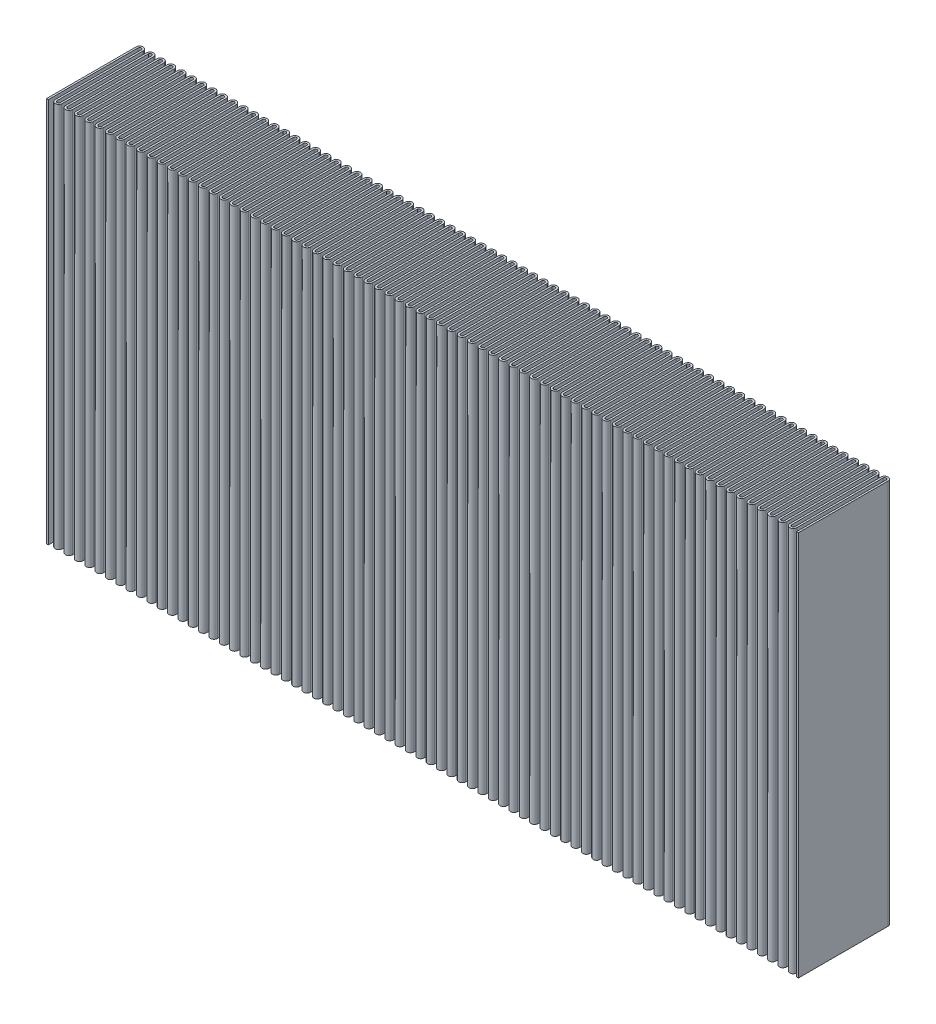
from build123d import *

# Parameters (mm, degrees)
BOSS_EXTRUDE1_DEPTH = 41


with BuildPart() as part:
    # Sketch1 → Boss-Extrude1 (new body)
    with BuildSketch(Plane(origin=(0, 0, 0), x_dir=(1, 0, 0), z_dir=(0, 1, 0))):
        with BuildLine():
            ThreePointArc((0, 9.7), (0.123743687, 9.648743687), (0.175, 9.525))
            Line((0.175, 9.525), (0.175, 0.375))
            ThreePointArc((0.175, 0.375), (0.284834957, 0.109834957), (0.55, 0))
            Line((0.55, 0), (0.55, 0.2))
            ThreePointArc((0.55, 0.2), (0.426256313, 0.251256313), (0.375, 0.375))
            Line((0.375, 0.375), (0.375, 9.525))
            ThreePointArc((0.375, 9.525), (0.265165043, 9.790165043), (0, 9.9))
            Line((0, 9.9), (0, 9.7))
        make_face()
        with BuildLine():
            ThreePointArc((-0.175, 9.525), (-0.123743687, 9.648743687), (0, 9.7))
            Line((0, 9.7), (0, 9.9))
            ThreePointArc((0, 9.9), (-0.265165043, 9.790165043), (-0.375, 9.525))
            Line((-0.375, 9.525), (-0.375, 0.375))
            Line((-0.375, 0.375), (-0.375, 0))
            Line((-0.375, 0), (-0.175, 0))
            Line((-0.175, 0), (-0.175, 0.375))
            Line((-0.175, 0.375), (-0.175, 9.525))
        make_face()
        with BuildLine():
            Line((0.55, 0.2), (0.55, 0))
            ThreePointArc((0.55, 0), (0.815165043, 0.109834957), (0.925, 0.375))
            Line((0.925, 0.375), (0.925, 9.525))
            ThreePointArc((0.925, 9.525), (0.976256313, 9.648743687), (1.1, 9.7))
            ThreePointArc((1.1, 9.7), (1.223743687, 9.648743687), (1.275, 9.525))
            Line((1.275, 9.525), (1.275, 0.375))
            ThreePointArc((1.275, 0.375), (1.65, 0), (2.025, 0.375))
            Line((2.025, 0.375), (2.025, 9.525))
            ThreePointArc((2.025, 9.525), (2.076256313, 9.648743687), (2.2, 9.7))
            ThreePointArc((2.2, 9.7), (2.323743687, 9.648743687), (2.375, 9.525))
            Line((2.375, 9.525), (2.375, 0.375))
            ThreePointArc((2.375, 0.375), (2.75, 0), (3.125, 0.375))
            Line((3.125, 0.375), (3.125, 9.525))
            ThreePointArc((3.125, 9.525), (3.176256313, 9.648743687), (3.3, 9.7))
            ThreePointArc((3.3, 9.7), (3.423743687, 9.648743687), (3.475, 9.525))
            Line((3.475, 9.525), (3.475, 0.375))
            ThreePointArc((3.475, 0.375), (3.85, 0), (4.225, 0.375))
            Line((4.225, 0.375), (4.225, 9.525))
            ThreePointArc((4.225, 9.525), (4.276256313, 9.648743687), (4.4, 9.7))
            ThreePointArc((4.4, 9.7), (4.523743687, 9.648743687), (4.575, 9.525))
            Line((4.575, 9.525), (4.575, 0.375))
            ThreePointArc((4.575, 0.375), (4.95, 0), (5.325, 0.375))
            Line((5.325, 0.375), (5.325, 9.525))
            ThreePointArc((5.325, 9.525), (5.376256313, 9.648743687), (5.5, 9.7))
            ThreePointArc((5.5, 9.7), (5.623743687, 9.648743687), (5.675, 9.525))
            Line((5.675, 9.525), (5.675, 0.375))
            ThreePointArc((5.675, 0.375), (6.05, 0), (6.425, 0.375))
            Line((6.425, 0.375), (6.425, 9.525))
            ThreePointArc((6.425, 9.525), (6.476256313, 9.648743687), (6.6, 9.7))
            ThreePointArc((6.6, 9.7), (6.723743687, 9.648743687), (6.775, 9.525))
            Line((6.775, 9.525), (6.775, 0.375))
            ThreePointArc((6.775, 0.375), (7.15, 0), (7.525, 0.375))
            Line((7.525, 0.375), (7.525, 9.525))
            ThreePointArc((7.525, 9.525), (7.576256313, 9.648743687), (7.7, 9.7))
            ThreePointArc((7.7, 9.7), (7.823743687, 9.648743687), (7.875, 9.525))
            Line((7.875, 9.525), (7.875, 0.375))
            ThreePointArc((7.875, 0.375), (8.25, 0), (8.625, 0.375))
            Line((8.625, 0.375), (8.625, 9.525))
            ThreePointArc((8.625, 9.525), (8.676256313, 9.648743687), (8.8, 9.7))
            ThreePointArc((8.8, 9.7), (8.923743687, 9.648743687), (8.975, 9.525))
            Line((8.975, 9.525), (8.975, 0.375))
            ThreePointArc((8.975, 0.375), (9.35, 0), (9.725, 0.375))
            Line((9.725, 0.375), (9.725, 9.525))
            ThreePointArc((9.725, 9.525), (9.776256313, 9.648743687), (9.9, 9.7))
            ThreePointArc((9.9, 9.7), (10.023743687, 9.648743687), (10.075, 9.525))
            Line((10.075, 9.525), (10.075, 0.375))
            ThreePointArc((10.075, 0.375), (10.45, 0), (10.825, 0.375))
            Line((10.825, 0.375), (10.825, 9.525))
            ThreePointArc((10.825, 9.525), (10.876256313, 9.648743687), (11, 9.7))
            ThreePointArc((11, 9.7), (11.123743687, 9.648743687), (11.175, 9.525))
            Line((11.175, 9.525), (11.175, 0.375))
            ThreePointArc((11.175, 0.375), (11.55, 0), (11.925, 0.375))
            Line((11.925, 0.375), (11.925, 9.525))
            ThreePointArc((11.925, 9.525), (11.976256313, 9.648743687), (12.1, 9.7))
            ThreePointArc((12.1, 9.7), (12.223743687, 9.648743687), (12.275, 9.525))
            Line((12.275, 9.525), (12.275, 0.375))
            ThreePointArc((12.275, 0.375), (12.65, 0), (13.025, 0.375))
            Line((13.025, 0.375), (13.025, 9.525))
            ThreePointArc((13.025, 9.525), (13.076256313, 9.648743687), (13.2, 9.7))
            ThreePointArc((13.2, 9.7), (13.323743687, 9.648743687), (13.375, 9.525))
            Line((13.375, 9.525), (13.375, 0.375))
            ThreePointArc((13.375, 0.375), (13.75, 0), (14.125, 0.375))
            Line((14.125, 0.375), (14.125, 9.525))
            ThreePointArc((14.125, 9.525), (14.176256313, 9.648743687), (14.3, 9.7))
            ThreePointArc((14.3, 9.7), (14.423743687, 9.648743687), (14.475, 9.525))
            Line((14.475, 9.525), (14.475, 0.375))
            ThreePointArc((14.475, 0.375), (14.85, 0), (15.225, 0.375))
            Line((15.225, 0.375), (15.225, 9.525))
            ThreePointArc((15.225, 9.525), (15.276256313, 9.648743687), (15.4, 9.7))
            ThreePointArc((15.4, 9.7), (15.523743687, 9.648743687), (15.575, 9.525))
            Line((15.575, 9.525), (15.575, 0.375))
            ThreePointArc((15.575, 0.375), (15.95, 0), (16.325, 0.375))
            Line((16.325, 0.375), (16.325, 9.525))
            ThreePointArc((16.325, 9.525), (16.376256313, 9.648743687), (16.5, 9.7))
            ThreePointArc((16.5, 9.7), (16.623743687, 9.648743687), (16.675, 9.525))
            Line((16.675, 9.525), (16.675, 0.375))
            ThreePointArc((16.675, 0.375), (17.05, 0), (17.425, 0.375))
            Line((17.425, 0.375), (17.425, 9.525))
            ThreePointArc((17.425, 9.525), (17.476256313, 9.648743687), (17.6, 9.7))
            ThreePointArc((17.6, 9.7), (17.723743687, 9.648743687), (17.775, 9.525))
            Line((17.775, 9.525), (17.775, 0.375))
            ThreePointArc((17.775, 0.375), (18.15, 0), (18.525, 0.375))
            Line((18.525, 0.375), (18.525, 9.525))
            ThreePointArc((18.525, 9.525), (18.576256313, 9.648743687), (18.7, 9.7))
            ThreePointArc((18.7, 9.7), (18.823743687, 9.648743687), (18.875, 9.525))
            Line((18.875, 9.525), (18.875, 0.375))
            ThreePointArc((18.875, 0.375), (19.25, 0), (19.625, 0.375))
            Line((19.625, 0.375), (19.625, 9.525))
            ThreePointArc((19.625, 9.525), (19.676256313, 9.648743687), (19.8, 9.7))
            ThreePointArc((19.8, 9.7), (19.923743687, 9.648743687), (19.975, 9.525))
            Line((19.975, 9.525), (19.975, 0.375))
            ThreePointArc((19.975, 0.375), (20.35, 0), (20.725, 0.375))
            Line((20.725, 0.375), (20.725, 9.525))
            ThreePointArc((20.725, 9.525), (20.776256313, 9.648743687), (20.9, 9.7))
            ThreePointArc((20.9, 9.7), (21.023743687, 9.648743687), (21.075, 9.525))
            Line((21.075, 9.525), (21.075, 0.375))
            ThreePointArc((21.075, 0.375), (21.45, 0), (21.825, 0.375))
            Line((21.825, 0.375), (21.825, 9.525))
            ThreePointArc((21.825, 9.525), (21.876256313, 9.648743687), (22, 9.7))
            ThreePointArc((22, 9.7), (22.123743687, 9.648743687), (22.175, 9.525))
            Line((22.175, 9.525), (22.175, 0.375))
            ThreePointArc((22.175, 0.375), (22.55, 0), (22.925, 0.375))
            Line((22.925, 0.375), (22.925, 9.525))
            ThreePointArc((22.925, 9.525), (22.976256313, 9.648743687), (23.1, 9.7))
            ThreePointArc((23.1, 9.7), (23.223743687, 9.648743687), (23.275, 9.525))
            Line((23.275, 9.525), (23.275, 0.375))
            ThreePointArc((23.275, 0.375), (23.65, 0), (24.025, 0.375))
            Line((24.025, 0.375), (24.025, 9.525))
            ThreePointArc((24.025, 9.525), (24.076256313, 9.648743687), (24.2, 9.7))
            ThreePointArc((24.2, 9.7), (24.323743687, 9.648743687), (24.375, 9.525))
            Line((24.375, 9.525), (24.375, 0.375))
            ThreePointArc((24.375, 0.375), (24.75, 0), (25.125, 0.375))
            Line((25.125, 0.375), (25.125, 9.525))
            ThreePointArc((25.125, 9.525), (25.176256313, 9.648743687), (25.3, 9.7))
            ThreePointArc((25.3, 9.7), (25.423743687, 9.648743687), (25.475, 9.525))
            Line((25.475, 9.525), (25.475, 0.375))
            ThreePointArc((25.475, 0.375), (25.85, 0), (26.225, 0.375))
            Line((26.225, 0.375), (26.225, 9.525))
            ThreePointArc((26.225, 9.525), (26.276256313, 9.648743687), (26.4, 9.7))
            ThreePointArc((26.4, 9.7), (26.523743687, 9.648743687), (26.575, 9.525))
            Line((26.575, 9.525), (26.575, 0.375))
            ThreePointArc((26.575, 0.375), (26.95, 0), (27.325, 0.375))
            Line((27.325, 0.375), (27.325, 9.525))
            ThreePointArc((27.325, 9.525), (27.376256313, 9.648743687), (27.5, 9.7))
            ThreePointArc((27.5, 9.7), (27.623743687, 9.648743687), (27.675, 9.525))
            Line((27.675, 9.525), (27.675, 0.375))
            ThreePointArc((27.675, 0.375), (28.05, 0), (28.425, 0.375))
            Line((28.425, 0.375), (28.425, 9.525))
            ThreePointArc((28.425, 9.525), (28.476256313, 9.648743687), (28.6, 9.7))
            ThreePointArc((28.6, 9.7), (28.723743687, 9.648743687), (28.775, 9.525))
            Line((28.775, 9.525), (28.775, 0.375))
            ThreePointArc((28.775, 0.375), (29.15, 0), (29.525, 0.375))
            Line((29.525, 0.375), (29.525, 9.525))
            ThreePointArc((29.525, 9.525), (29.576256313, 9.648743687), (29.7, 9.7))
            ThreePointArc((29.7, 9.7), (29.823743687, 9.648743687), (29.875, 9.525))
            Line((29.875, 9.525), (29.875, 0.375))
            ThreePointArc((29.875, 0.375), (30.25, 0), (30.625, 0.375))
            Line((30.625, 0.375), (30.625, 9.525))
            ThreePointArc((30.625, 9.525), (30.676256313, 9.648743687), (30.8, 9.7))
            ThreePointArc((30.8, 9.7), (30.923743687, 9.648743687), (30.975, 9.525))
            Line((30.975, 9.525), (30.975, 0.375))
            ThreePointArc((30.975, 0.375), (31.35, 0), (31.725, 0.375))
            Line((31.725, 0.375), (31.725, 9.525))
            ThreePointArc((31.725, 9.525), (31.776256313, 9.648743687), (31.9, 9.7))
            ThreePointArc((31.9, 9.7), (32.023743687, 9.648743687), (32.075, 9.525))
            Line((32.075, 9.525), (32.075, 0.375))
            ThreePointArc((32.075, 0.375), (32.45, 0), (32.825, 0.375))
            Line((32.825, 0.375), (32.825, 9.525))
            ThreePointArc((32.825, 9.525), (32.876256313, 9.648743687), (33, 9.7))
            ThreePointArc((33, 9.7), (33.123743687, 9.648743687), (33.175, 9.525))
            Line((33.175, 9.525), (33.175, 0.375))
            ThreePointArc((33.175, 0.375), (33.55, 0), (33.925, 0.375))
            Line((33.925, 0.375), (33.925, 9.525))
            ThreePointArc((33.925, 9.525), (33.976256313, 9.648743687), (34.1, 9.7))
            ThreePointArc((34.1, 9.7), (34.223743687, 9.648743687), (34.275, 9.525))
            Line((34.275, 9.525), (34.275, 0.375))
            ThreePointArc((34.275, 0.375), (34.65, 0), (35.025, 0.375))
            Line((35.025, 0.375), (35.025, 9.525))
            ThreePointArc((35.025, 9.525), (35.076256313, 9.648743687), (35.2, 9.7))
            ThreePointArc((35.2, 9.7), (35.323743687, 9.648743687), (35.375, 9.525))
            Line((35.375, 9.525), (35.375, 0.375))
            ThreePointArc((35.375, 0.375), (35.75, 0), (36.125, 0.375))
            Line((36.125, 0.375), (36.125, 9.525))
            ThreePointArc((36.125, 9.525), (36.176256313, 9.648743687), (36.3, 9.7))
            ThreePointArc((36.3, 9.7), (36.423743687, 9.648743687), (36.475, 9.525))
            Line((36.475, 9.525), (36.475, 0.375))
            ThreePointArc((36.475, 0.375), (36.85, 0), (37.225, 0.375))
            Line((37.225, 0.375), (37.225, 9.525))
            ThreePointArc((37.225, 9.525), (37.276256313, 9.648743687), (37.4, 9.7))
            ThreePointArc((37.4, 9.7), (37.523743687, 9.648743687), (37.575, 9.525))
            Line((37.575, 9.525), (37.575, 0.375))
            ThreePointArc((37.575, 0.375), (37.95, 0), (38.325, 0.375))
            Line((38.325, 0.375), (38.325, 9.525))
            ThreePointArc((38.325, 9.525), (38.376256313, 9.648743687), (38.5, 9.7))
            ThreePointArc((38.5, 9.7), (38.623743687, 9.648743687), (38.675, 9.525))
            Line((38.675, 9.525), (38.675, 0.375))
            ThreePointArc((38.675, 0.375), (39.05, 0), (39.425, 0.375))
            Line((39.425, 0.375), (39.425, 9.525))
            ThreePointArc((39.425, 9.525), (39.476256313, 9.648743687), (39.6, 9.7))
            ThreePointArc((39.6, 9.7), (39.723743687, 9.648743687), (39.775, 9.525))
            Line((39.775, 9.525), (39.775, 0.375))
            ThreePointArc((39.775, 0.375), (40.15, 0), (40.525, 0.375))
            Line((40.525, 0.375), (40.525, 9.525))
            ThreePointArc((40.525, 9.525), (40.576256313, 9.648743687), (40.7, 9.7))
            ThreePointArc((40.7, 9.7), (40.823743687, 9.648743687), (40.875, 9.525))
            Line((40.875, 9.525), (40.875, 0.375))
            ThreePointArc((40.875, 0.375), (41.25, 0), (41.625, 0.375))
            Line((41.625, 0.375), (41.625, 9.525))
            ThreePointArc((41.625, 9.525), (41.676256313, 9.648743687), (41.8, 9.7))
            ThreePointArc((41.8, 9.7), (41.923743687, 9.648743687), (41.975, 9.525))
            Line((41.975, 9.525), (41.975, 0.375))
            ThreePointArc((41.975, 0.375), (42.35, 0), (42.725, 0.375))
            Line((42.725, 0.375), (42.725, 9.525))
            ThreePointArc((42.725, 9.525), (42.776256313, 9.648743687), (42.9, 9.7))
            ThreePointArc((42.9, 9.7), (43.023743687, 9.648743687), (43.075, 9.525))
            Line((43.075, 9.525), (43.075, 0.375))
            ThreePointArc((43.075, 0.375), (43.45, 0), (43.825, 0.375))
            Line((43.825, 0.375), (43.825, 9.525))
            ThreePointArc((43.825, 9.525), (43.876256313, 9.648743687), (44, 9.7))
            ThreePointArc((44, 9.7), (44.123743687, 9.648743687), (44.175, 9.525))
            Line((44.175, 9.525), (44.175, 0.375))
            ThreePointArc((44.175, 0.375), (44.55, 0), (44.925, 0.375))
            Line((44.925, 0.375), (44.925, 9.525))
            ThreePointArc((44.925, 9.525), (44.976256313, 9.648743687), (45.1, 9.7))
            ThreePointArc((45.1, 9.7), (45.223743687, 9.648743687), (45.275, 9.525))
            Line((45.275, 9.525), (45.275, 0.375))
            ThreePointArc((45.275, 0.375), (45.65, 0), (46.025, 0.375))
            Line((46.025, 0.375), (46.025, 9.525))
            ThreePointArc((46.025, 9.525), (46.076256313, 9.648743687), (46.2, 9.7))
            ThreePointArc((46.2, 9.7), (46.323743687, 9.648743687), (46.375, 9.525))
            Line((46.375, 9.525), (46.375, 0.375))
            ThreePointArc((46.375, 0.375), (46.75, 0), (47.125, 0.375))
            Line((47.125, 0.375), (47.125, 9.525))
            ThreePointArc((47.125, 9.525), (47.176256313, 9.648743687), (47.3, 9.7))
            ThreePointArc((47.3, 9.7), (47.423743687, 9.648743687), (47.475, 9.525))
            Line((47.475, 9.525), (47.475, 0.375))
            ThreePointArc((47.475, 0.375), (47.85, 0), (48.225, 0.375))
            Line((48.225, 0.375), (48.225, 9.525))
            ThreePointArc((48.225, 9.525), (48.276256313, 9.648743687), (48.4, 9.7))
            ThreePointArc((48.4, 9.7), (48.523743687, 9.648743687), (48.575, 9.525))
            Line((48.575, 9.525), (48.575, 0.375))
            ThreePointArc((48.575, 0.375), (48.95, 0), (49.325, 0.375))
            Line((49.325, 0.375), (49.325, 9.525))
            ThreePointArc((49.325, 9.525), (49.376256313, 9.648743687), (49.5, 9.7))
            ThreePointArc((49.5, 9.7), (49.623743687, 9.648743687), (49.675, 9.525))
            Line((49.675, 9.525), (49.675, 0.375))
            ThreePointArc((49.675, 0.375), (50.05, 0), (50.425, 0.375))
            Line((50.425, 0.375), (50.425, 9.525))
            ThreePointArc((50.425, 9.525), (50.476256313, 9.648743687), (50.6, 9.7))
            ThreePointArc((50.6, 9.7), (50.723743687, 9.648743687), (50.775, 9.525))
            Line((50.775, 9.525), (50.775, 0.375))
            ThreePointArc((50.775, 0.375), (51.15, 0), (51.525, 0.375))
            Line((51.525, 0.375), (51.525, 9.525))
            ThreePointArc((51.525, 9.525), (51.576256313, 9.648743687), (51.7, 9.7))
            ThreePointArc((51.7, 9.7), (51.823743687, 9.648743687), (51.875, 9.525))
            Line((51.875, 9.525), (51.875, 0.375))
            ThreePointArc((51.875, 0.375), (52.25, 0), (52.625, 0.375))
            Line((52.625, 0.375), (52.625, 9.525))
            ThreePointArc((52.625, 9.525), (52.676256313, 9.648743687), (52.8, 9.7))
            ThreePointArc((52.8, 9.7), (52.923743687, 9.648743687), (52.975, 9.525))
            Line((52.975, 9.525), (52.975, 0.375))
            ThreePointArc((52.975, 0.375), (53.35, 0), (53.725, 0.375))
            Line((53.725, 0.375), (53.725, 9.525))
            ThreePointArc((53.725, 9.525), (53.776256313, 9.648743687), (53.9, 9.7))
            ThreePointArc((53.9, 9.7), (54.023743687, 9.648743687), (54.075, 9.525))
            Line((54.075, 9.525), (54.075, 0.375))
            ThreePointArc((54.075, 0.375), (54.45, 0), (54.825, 0.375))
            Line((54.825, 0.375), (54.825, 9.525))
            ThreePointArc((54.825, 9.525), (54.876256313, 9.648743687), (55, 9.7))
            ThreePointArc((55, 9.7), (55.123743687, 9.648743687), (55.175, 9.525))
            Line((55.175, 9.525), (55.175, 0.375))
            ThreePointArc((55.175, 0.375), (55.55, 0), (55.925, 0.375))
            Line((55.925, 0.375), (55.925, 9.525))
            ThreePointArc((55.925, 9.525), (55.976256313, 9.648743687), (56.1, 9.7))
            ThreePointArc((56.1, 9.7), (56.223743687, 9.648743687), (56.275, 9.525))
            Line((56.275, 9.525), (56.275, 0.375))
            ThreePointArc((56.275, 0.375), (56.65, 0), (57.025, 0.375))
            Line((57.025, 0.375), (57.025, 9.525))
            ThreePointArc((57.025, 9.525), (57.076256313, 9.648743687), (57.2, 9.7))
            ThreePointArc((57.2, 9.7), (57.323743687, 9.648743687), (57.375, 9.525))
            Line((57.375, 9.525), (57.375, 0.375))
            ThreePointArc((57.375, 0.375), (57.75, 0), (58.125, 0.375))
            Line((58.125, 0.375), (58.125, 9.525))
            ThreePointArc((58.125, 9.525), (58.176256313, 9.648743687), (58.3, 9.7))
            ThreePointArc((58.3, 9.7), (58.423743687, 9.648743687), (58.475, 9.525))
            Line((58.475, 9.525), (58.475, 0.375))
            ThreePointArc((58.475, 0.375), (58.85, 0), (59.225, 0.375))
            Line((59.225, 0.375), (59.225, 9.525))
            ThreePointArc((59.225, 9.525), (59.276256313, 9.648743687), (59.4, 9.7))
            ThreePointArc((59.4, 9.7), (59.523743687, 9.648743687), (59.575, 9.525))
            Line((59.575, 9.525), (59.575, 0.375))
            ThreePointArc((59.575, 0.375), (59.95, 0), (60.325, 0.375))
            Line((60.325, 0.375), (60.325, 9.525))
            ThreePointArc((60.325, 9.525), (60.376256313, 9.648743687), (60.5, 9.7))
            ThreePointArc((60.5, 9.7), (60.623743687, 9.648743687), (60.675, 9.525))
            Line((60.675, 9.525), (60.675, 0.375))
            ThreePointArc((60.675, 0.375), (61.05, 0), (61.425, 0.375))
            Line((61.425, 0.375), (61.425, 9.525))
            ThreePointArc((61.425, 9.525), (61.476256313, 9.648743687), (61.6, 9.7))
            ThreePointArc((61.6, 9.7), (61.723743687, 9.648743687), (61.775, 9.525))
            Line((61.775, 9.525), (61.775, 0.375))
            ThreePointArc((61.775, 0.375), (62.15, 0), (62.525, 0.375))
            Line((62.525, 0.375), (62.525, 9.525))
            ThreePointArc((62.525, 9.525), (62.576256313, 9.648743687), (62.7, 9.7))
            ThreePointArc((62.7, 9.7), (62.823743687, 9.648743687), (62.875, 9.525))
            Line((62.875, 9.525), (62.875, 0.375))
            ThreePointArc((62.875, 0.375), (63.25, 0), (63.625, 0.375))
            Line((63.625, 0.375), (63.625, 9.525))
            ThreePointArc((63.625, 9.525), (63.676256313, 9.648743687), (63.8, 9.7))
            ThreePointArc((63.8, 9.7), (63.923743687, 9.648743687), (63.975, 9.525))
            Line((63.975, 9.525), (63.975, 0.375))
            ThreePointArc((63.975, 0.375), (64.35, 0), (64.725, 0.375))
            Line((64.725, 0.375), (64.725, 9.525))
            ThreePointArc((64.725, 9.525), (64.776256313, 9.648743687), (64.9, 9.7))
            ThreePointArc((64.9, 9.7), (65.023743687, 9.648743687), (65.075, 9.525))
            Line((65.075, 9.525), (65.075, 0.375))
            ThreePointArc((65.075, 0.375), (65.45, 0), (65.825, 0.375))
            Line((65.825, 0.375), (65.825, 9.525))
            ThreePointArc((65.825, 9.525), (65.876256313, 9.648743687), (66, 9.7))
            ThreePointArc((66, 9.7), (66.123743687, 9.648743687), (66.175, 9.525))
            Line((66.175, 9.525), (66.175, 0.375))
            ThreePointArc((66.175, 0.375), (66.55, 0), (66.925, 0.375))
            Line((66.925, 0.375), (66.925, 9.525))
            ThreePointArc((66.925, 9.525), (66.976256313, 9.648743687), (67.1, 9.7))
            ThreePointArc((67.1, 9.7), (67.223743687, 9.648743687), (67.275, 9.525))
            Line((67.275, 9.525), (67.275, 0.375))
            ThreePointArc((67.275, 0.375), (67.65, 0), (68.025, 0.375))
            Line((68.025, 0.375), (68.025, 9.525))
            ThreePointArc((68.025, 9.525), (68.076256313, 9.648743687), (68.2, 9.7))
            ThreePointArc((68.2, 9.7), (68.323743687, 9.648743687), (68.375, 9.525))
            Line((68.375, 9.525), (68.375, 0.375))
            ThreePointArc((68.375, 0.375), (68.75, 0), (69.125, 0.375))
            Line((69.125, 0.375), (69.125, 9.525))
            ThreePointArc((69.125, 9.525), (69.176256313, 9.648743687), (69.3, 9.7))
            ThreePointArc((69.3, 9.7), (69.423743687, 9.648743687), (69.475, 9.525))
            Line((69.475, 9.525), (69.475, 0.375))
            ThreePointArc((69.475, 0.375), (69.85, 0), (70.225, 0.375))
            Line((70.225, 0.375), (70.225, 9.525))
            ThreePointArc((70.225, 9.525), (70.276256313, 9.648743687), (70.4, 9.7))
            ThreePointArc((70.4, 9.7), (70.523743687, 9.648743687), (70.575, 9.525))
            Line((70.575, 9.525), (70.575, 0.375))
            ThreePointArc((70.575, 0.375), (70.95, 0), (71.325, 0.375))
            Line((71.325, 0.375), (71.325, 9.525))
            ThreePointArc((71.325, 9.525), (71.376256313, 9.648743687), (71.5, 9.7))
            ThreePointArc((71.5, 9.7), (71.623743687, 9.648743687), (71.675, 9.525))
            Line((71.675, 9.525), (71.675, 0.375))
            ThreePointArc((71.675, 0.375), (72.05, 0), (72.425, 0.375))
            Line((72.425, 0.375), (72.425, 9.525))
            ThreePointArc((72.425, 9.525), (72.476256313, 9.648743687), (72.6, 9.7))
            ThreePointArc((72.6, 9.7), (72.723743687, 9.648743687), (72.775, 9.525))
            Line((72.775, 9.525), (72.775, 0.375))
            ThreePointArc((72.775, 0.375), (73.15, 0), (73.525, 0.375))
            Line((73.525, 0.375), (73.525, 9.525))
            ThreePointArc((73.525, 9.525), (73.576256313, 9.648743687), (73.7, 9.7))
            ThreePointArc((73.7, 9.7), (73.823743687, 9.648743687), (73.875, 9.525))
            Line((73.875, 9.525), (73.875, 0.375))
            ThreePointArc((73.875, 0.375), (74.25, 0), (74.625, 0.375))
            Line((74.625, 0.375), (74.625, 9.525))
            ThreePointArc((74.625, 9.525), (74.676256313, 9.648743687), (74.8, 9.7))
            ThreePointArc((74.8, 9.7), (74.923743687, 9.648743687), (74.975, 9.525))
            Line((74.975, 9.525), (74.975, 0.375))
            ThreePointArc((74.975, 0.375), (75.35, 0), (75.725, 0.375))
            Line((75.725, 0.375), (75.725, 9.525))
            ThreePointArc((75.725, 9.525), (75.776256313, 9.648743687), (75.9, 9.7))
            ThreePointArc((75.9, 9.7), (76.023743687, 9.648743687), (76.075, 9.525))
            Line((76.075, 9.525), (76.075, 0.375))
            ThreePointArc((76.075, 0.375), (76.45, 0), (76.825, 0.375))
            Line((76.825, 0.375), (76.825, 9.525))
            ThreePointArc((76.825, 9.525), (76.876256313, 9.648743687), (77, 9.7))
            ThreePointArc((77, 9.7), (77.123743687, 9.648743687), (77.175, 9.525))
            Line((77.175, 9.525), (77.175, 0.375))
            ThreePointArc((77.175, 0.375), (77.55, 0), (77.925, 0.375))
            Line((77.925, 0.375), (77.925, 9.525))
            ThreePointArc((77.925, 9.525), (77.976256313, 9.648743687), (78.1, 9.7))
            ThreePointArc((78.1, 9.7), (78.223743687, 9.648743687), (78.275, 9.525))
            Line((78.275, 9.525), (78.275, 0.375))
            ThreePointArc((78.275, 0.375), (78.65, 0), (79.025, 0.375))
            Line((79.025, 0.375), (79.025, 9.525))
            ThreePointArc((79.025, 9.525), (79.076256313, 9.648743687), (79.2, 9.7))
            ThreePointArc((79.2, 9.7), (79.323743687, 9.648743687), (79.375, 9.525))
            Line((79.375, 9.525), (79.375, 0))
            Line((79.375, 0), (79.575, 0))
            Line((79.575, 0), (79.575, 9.525))
            ThreePointArc((79.575, 9.525), (79.465165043, 9.790165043), (79.2, 9.9))
            ThreePointArc((79.2, 9.9), (78.934834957, 9.790165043), (78.825, 9.525))
            Line((78.825, 9.525), (78.825, 0.375))
            ThreePointArc((78.825, 0.375), (78.65, 0.2), (78.475, 0.375))
            Line((78.475, 0.375), (78.475, 9.525))
            ThreePointArc((78.475, 9.525), (78.365165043, 9.790165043), (78.1, 9.9))
            ThreePointArc((78.1, 9.9), (77.834834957, 9.790165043), (77.725, 9.525))
            Line((77.725, 9.525), (77.725, 0.375))
            ThreePointArc((77.725, 0.375), (77.55, 0.2), (77.375, 0.375))
            Line((77.375, 0.375), (77.375, 9.525))
            ThreePointArc((77.375, 9.525), (77.265165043, 9.790165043), (77, 9.9))
            ThreePointArc((77, 9.9), (76.734834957, 9.790165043), (76.625, 9.525))
            Line((76.625, 9.525), (76.625, 0.375))
            ThreePointArc((76.625, 0.375), (76.45, 0.2), (76.275, 0.375))
            Line((76.275, 0.375), (76.275, 9.525))
            ThreePointArc((76.275, 9.525), (76.165165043, 9.790165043), (75.9, 9.9))
            ThreePointArc((75.9, 9.9), (75.634834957, 9.790165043), (75.525, 9.525))
            Line((75.525, 9.525), (75.525, 0.375))
            ThreePointArc((75.525, 0.375), (75.35, 0.2), (75.175, 0.375))
            Line((75.175, 0.375), (75.175, 9.525))
            ThreePointArc((75.175, 9.525), (75.065165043, 9.790165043), (74.8, 9.9))
            ThreePointArc((74.8, 9.9), (74.534834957, 9.790165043), (74.425, 9.525))
            Line((74.425, 9.525), (74.425, 0.375))
            ThreePointArc((74.425, 0.375), (74.25, 0.2), (74.075, 0.375))
            Line((74.075, 0.375), (74.075, 9.525))
            ThreePointArc((74.075, 9.525), (73.965165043, 9.790165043), (73.7, 9.9))
            ThreePointArc((73.7, 9.9), (73.434834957, 9.790165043), (73.325, 9.525))
            Line((73.325, 9.525), (73.325, 0.375))
            ThreePointArc((73.325, 0.375), (73.15, 0.2), (72.975, 0.375))
            Line((72.975, 0.375), (72.975, 9.525))
            ThreePointArc((72.975, 9.525), (72.865165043, 9.790165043), (72.6, 9.9))
            ThreePointArc((72.6, 9.9), (72.334834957, 9.790165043), (72.225, 9.525))
            Line((72.225, 9.525), (72.225, 0.375))
            ThreePointArc((72.225, 0.375), (72.05, 0.2), (71.875, 0.375))
            Line((71.875, 0.375), (71.875, 9.525))
            ThreePointArc((71.875, 9.525), (71.765165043, 9.790165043), (71.5, 9.9))
            ThreePointArc((71.5, 9.9), (71.234834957, 9.790165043), (71.125, 9.525))
            Line((71.125, 9.525), (71.125, 0.375))
            ThreePointArc((71.125, 0.375), (70.95, 0.2), (70.775, 0.375))
            Line((70.775, 0.375), (70.775, 9.525))
            ThreePointArc((70.775, 9.525), (70.665165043, 9.790165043), (70.4, 9.9))
            ThreePointArc((70.4, 9.9), (70.134834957, 9.790165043), (70.025, 9.525))
            Line((70.025, 9.525), (70.025, 0.375))
            ThreePointArc((70.025, 0.375), (69.85, 0.2), (69.675, 0.375))
            Line((69.675, 0.375), (69.675, 9.525))
            ThreePointArc((69.675, 9.525), (69.565165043, 9.790165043), (69.3, 9.9))
            ThreePointArc((69.3, 9.9), (69.034834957, 9.790165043), (68.925, 9.525))
            Line((68.925, 9.525), (68.925, 0.375))
            ThreePointArc((68.925, 0.375), (68.75, 0.2), (68.575, 0.375))
            Line((68.575, 0.375), (68.575, 9.525))
            ThreePointArc((68.575, 9.525), (68.465165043, 9.790165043), (68.2, 9.9))
            ThreePointArc((68.2, 9.9), (67.934834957, 9.790165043), (67.825, 9.525))
            Line((67.825, 9.525), (67.825, 0.375))
            ThreePointArc((67.825, 0.375), (67.65, 0.2), (67.475, 0.375))
            Line((67.475, 0.375), (67.475, 9.525))
            ThreePointArc((67.475, 9.525), (67.365165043, 9.790165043), (67.1, 9.9))
            ThreePointArc((67.1, 9.9), (66.834834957, 9.790165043), (66.725, 9.525))
            Line((66.725, 9.525), (66.725, 0.375))
            ThreePointArc((66.725, 0.375), (66.55, 0.2), (66.375, 0.375))
            Line((66.375, 0.375), (66.375, 9.525))
            ThreePointArc((66.375, 9.525), (66.265165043, 9.790165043), (66, 9.9))
            ThreePointArc((66, 9.9), (65.734834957, 9.790165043), (65.625, 9.525))
            Line((65.625, 9.525), (65.625, 0.375))
            ThreePointArc((65.625, 0.375), (65.45, 0.2), (65.275, 0.375))
            Line((65.275, 0.375), (65.275, 9.525))
            ThreePointArc((65.275, 9.525), (65.165165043, 9.790165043), (64.9, 9.9))
            ThreePointArc((64.9, 9.9), (64.634834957, 9.790165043), (64.525, 9.525))
            Line((64.525, 9.525), (64.525, 0.375))
            ThreePointArc((64.525, 0.375), (64.35, 0.2), (64.175, 0.375))
            Line((64.175, 0.375), (64.175, 9.525))
            ThreePointArc((64.175, 9.525), (64.065165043, 9.790165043), (63.8, 9.9))
            ThreePointArc((63.8, 9.9), (63.534834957, 9.790165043), (63.425, 9.525))
            Line((63.425, 9.525), (63.425, 0.375))
            ThreePointArc((63.425, 0.375), (63.25, 0.2), (63.075, 0.375))
            Line((63.075, 0.375), (63.075, 9.525))
            ThreePointArc((63.075, 9.525), (62.965165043, 9.790165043), (62.7, 9.9))
            ThreePointArc((62.7, 9.9), (62.434834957, 9.790165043), (62.325, 9.525))
            Line((62.325, 9.525), (62.325, 0.375))
            ThreePointArc((62.325, 0.375), (62.15, 0.2), (61.975, 0.375))
            Line((61.975, 0.375), (61.975, 9.525))
            ThreePointArc((61.975, 9.525), (61.865165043, 9.790165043), (61.6, 9.9))
            ThreePointArc((61.6, 9.9), (61.334834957, 9.790165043), (61.225, 9.525))
            Line((61.225, 9.525), (61.225, 0.375))
            ThreePointArc((61.225, 0.375), (61.05, 0.2), (60.875, 0.375))
            Line((60.875, 0.375), (60.875, 9.525))
            ThreePointArc((60.875, 9.525), (60.765165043, 9.790165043), (60.5, 9.9))
            ThreePointArc((60.5, 9.9), (60.234834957, 9.790165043), (60.125, 9.525))
            Line((60.125, 9.525), (60.125, 0.375))
            ThreePointArc((60.125, 0.375), (59.95, 0.2), (59.775, 0.375))
            Line((59.775, 0.375), (59.775, 9.525))
            ThreePointArc((59.775, 9.525), (59.665165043, 9.790165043), (59.4, 9.9))
            ThreePointArc((59.4, 9.9), (59.134834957, 9.790165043), (59.025, 9.525))
            Line((59.025, 9.525), (59.025, 0.375))
            ThreePointArc((59.025, 0.375), (58.85, 0.2), (58.675, 0.375))
            Line((58.675, 0.375), (58.675, 9.525))
            ThreePointArc((58.675, 9.525), (58.565165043, 9.790165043), (58.3, 9.9))
            ThreePointArc((58.3, 9.9), (58.034834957, 9.790165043), (57.925, 9.525))
            Line((57.925, 9.525), (57.925, 0.375))
            ThreePointArc((57.925, 0.375), (57.75, 0.2), (57.575, 0.375))
            Line((57.575, 0.375), (57.575, 9.525))
            ThreePointArc((57.575, 9.525), (57.465165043, 9.790165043), (57.2, 9.9))
            ThreePointArc((57.2, 9.9), (56.934834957, 9.790165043), (56.825, 9.525))
            Line((56.825, 9.525), (56.825, 0.375))
            ThreePointArc((56.825, 0.375), (56.65, 0.2), (56.475, 0.375))
            Line((56.475, 0.375), (56.475, 9.525))
            ThreePointArc((56.475, 9.525), (56.365165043, 9.790165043), (56.1, 9.9))
            ThreePointArc((56.1, 9.9), (55.834834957, 9.790165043), (55.725, 9.525))
            Line((55.725, 9.525), (55.725, 0.375))
            ThreePointArc((55.725, 0.375), (55.55, 0.2), (55.375, 0.375))
            Line((55.375, 0.375), (55.375, 9.525))
            ThreePointArc((55.375, 9.525), (55.265165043, 9.790165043), (55, 9.9))
            ThreePointArc((55, 9.9), (54.734834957, 9.790165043), (54.625, 9.525))
            Line((54.625, 9.525), (54.625, 0.375))
            ThreePointArc((54.625, 0.375), (54.45, 0.2), (54.275, 0.375))
            Line((54.275, 0.375), (54.275, 9.525))
            ThreePointArc((54.275, 9.525), (54.165165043, 9.790165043), (53.9, 9.9))
            ThreePointArc((53.9, 9.9), (53.634834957, 9.790165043), (53.525, 9.525))
            Line((53.525, 9.525), (53.525, 0.375))
            ThreePointArc((53.525, 0.375), (53.35, 0.2), (53.175, 0.375))
            Line((53.175, 0.375), (53.175, 9.525))
            ThreePointArc((53.175, 9.525), (53.065165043, 9.790165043), (52.8, 9.9))
            ThreePointArc((52.8, 9.9), (52.534834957, 9.790165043), (52.425, 9.525))
            Line((52.425, 9.525), (52.425, 0.375))
            ThreePointArc((52.425, 0.375), (52.25, 0.2), (52.075, 0.375))
            Line((52.075, 0.375), (52.075, 9.525))
            ThreePointArc((52.075, 9.525), (51.965165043, 9.790165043), (51.7, 9.9))
            ThreePointArc((51.7, 9.9), (51.434834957, 9.790165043), (51.325, 9.525))
            Line((51.325, 9.525), (51.325, 0.375))
            ThreePointArc((51.325, 0.375), (51.15, 0.2), (50.975, 0.375))
            Line((50.975, 0.375), (50.975, 9.525))
            ThreePointArc((50.975, 9.525), (50.865165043, 9.790165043), (50.6, 9.9))
            ThreePointArc((50.6, 9.9), (50.334834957, 9.790165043), (50.225, 9.525))
            Line((50.225, 9.525), (50.225, 0.375))
            ThreePointArc((50.225, 0.375), (50.05, 0.2), (49.875, 0.375))
            Line((49.875, 0.375), (49.875, 9.525))
            ThreePointArc((49.875, 9.525), (49.765165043, 9.790165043), (49.5, 9.9))
            ThreePointArc((49.5, 9.9), (49.234834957, 9.790165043), (49.125, 9.525))
            Line((49.125, 9.525), (49.125, 0.375))
            ThreePointArc((49.125, 0.375), (48.95, 0.2), (48.775, 0.375))
            Line((48.775, 0.375), (48.775, 9.525))
            ThreePointArc((48.775, 9.525), (48.665165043, 9.790165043), (48.4, 9.9))
            ThreePointArc((48.4, 9.9), (48.134834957, 9.790165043), (48.025, 9.525))
            Line((48.025, 9.525), (48.025, 0.375))
            ThreePointArc((48.025, 0.375), (47.85, 0.2), (47.675, 0.375))
            Line((47.675, 0.375), (47.675, 9.525))
            ThreePointArc((47.675, 9.525), (47.565165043, 9.790165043), (47.3, 9.9))
            ThreePointArc((47.3, 9.9), (47.034834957, 9.790165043), (46.925, 9.525))
            Line((46.925, 9.525), (46.925, 0.375))
            ThreePointArc((46.925, 0.375), (46.75, 0.2), (46.575, 0.375))
            Line((46.575, 0.375), (46.575, 9.525))
            ThreePointArc((46.575, 9.525), (46.465165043, 9.790165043), (46.2, 9.9))
            ThreePointArc((46.2, 9.9), (45.934834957, 9.790165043), (45.825, 9.525))
            Line((45.825, 9.525), (45.825, 0.375))
            ThreePointArc((45.825, 0.375), (45.65, 0.2), (45.475, 0.375))
            Line((45.475, 0.375), (45.475, 9.525))
            ThreePointArc((45.475, 9.525), (45.365165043, 9.790165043), (45.1, 9.9))
            ThreePointArc((45.1, 9.9), (44.834834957, 9.790165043), (44.725, 9.525))
            Line((44.725, 9.525), (44.725, 0.375))
            ThreePointArc((44.725, 0.375), (44.55, 0.2), (44.375, 0.375))
            Line((44.375, 0.375), (44.375, 9.525))
            ThreePointArc((44.375, 9.525), (44.265165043, 9.790165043), (44, 9.9))
            ThreePointArc((44, 9.9), (43.734834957, 9.790165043), (43.625, 9.525))
            Line((43.625, 9.525), (43.625, 0.375))
            ThreePointArc((43.625, 0.375), (43.45, 0.2), (43.275, 0.375))
            Line((43.275, 0.375), (43.275, 9.525))
            ThreePointArc((43.275, 9.525), (43.165165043, 9.790165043), (42.9, 9.9))
            ThreePointArc((42.9, 9.9), (42.634834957, 9.790165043), (42.525, 9.525))
            Line((42.525, 9.525), (42.525, 0.375))
            ThreePointArc((42.525, 0.375), (42.35, 0.2), (42.175, 0.375))
            Line((42.175, 0.375), (42.175, 9.525))
            ThreePointArc((42.175, 9.525), (42.065165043, 9.790165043), (41.8, 9.9))
            ThreePointArc((41.8, 9.9), (41.534834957, 9.790165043), (41.425, 9.525))
            Line((41.425, 9.525), (41.425, 0.375))
            ThreePointArc((41.425, 0.375), (41.25, 0.2), (41.075, 0.375))
            Line((41.075, 0.375), (41.075, 9.525))
            ThreePointArc((41.075, 9.525), (40.965165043, 9.790165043), (40.7, 9.9))
            ThreePointArc((40.7, 9.9), (40.434834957, 9.790165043), (40.325, 9.525))
            Line((40.325, 9.525), (40.325, 0.375))
            ThreePointArc((40.325, 0.375), (40.15, 0.2), (39.975, 0.375))
            Line((39.975, 0.375), (39.975, 9.525))
            ThreePointArc((39.975, 9.525), (39.865165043, 9.790165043), (39.6, 9.9))
            ThreePointArc((39.6, 9.9), (39.334834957, 9.790165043), (39.225, 9.525))
            Line((39.225, 9.525), (39.225, 0.375))
            ThreePointArc((39.225, 0.375), (39.05, 0.2), (38.875, 0.375))
            Line((38.875, 0.375), (38.875, 9.525))
            ThreePointArc((38.875, 9.525), (38.765165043, 9.790165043), (38.5, 9.9))
            ThreePointArc((38.5, 9.9), (38.234834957, 9.790165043), (38.125, 9.525))
            Line((38.125, 9.525), (38.125, 0.375))
            ThreePointArc((38.125, 0.375), (37.95, 0.2), (37.775, 0.375))
            Line((37.775, 0.375), (37.775, 9.525))
            ThreePointArc((37.775, 9.525), (37.665165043, 9.790165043), (37.4, 9.9))
            ThreePointArc((37.4, 9.9), (37.134834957, 9.790165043), (37.025, 9.525))
            Line((37.025, 9.525), (37.025, 0.375))
            ThreePointArc((37.025, 0.375), (36.85, 0.2), (36.675, 0.375))
            Line((36.675, 0.375), (36.675, 9.525))
            ThreePointArc((36.675, 9.525), (36.565165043, 9.790165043), (36.3, 9.9))
            ThreePointArc((36.3, 9.9), (36.034834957, 9.790165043), (35.925, 9.525))
            Line((35.925, 9.525), (35.925, 0.375))
            ThreePointArc((35.925, 0.375), (35.75, 0.2), (35.575, 0.375))
            Line((35.575, 0.375), (35.575, 9.525))
            ThreePointArc((35.575, 9.525), (35.465165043, 9.790165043), (35.2, 9.9))
            ThreePointArc((35.2, 9.9), (34.934834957, 9.790165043), (34.825, 9.525))
            Line((34.825, 9.525), (34.825, 0.375))
            ThreePointArc((34.825, 0.375), (34.65, 0.2), (34.475, 0.375))
            Line((34.475, 0.375), (34.475, 9.525))
            ThreePointArc((34.475, 9.525), (34.365165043, 9.790165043), (34.1, 9.9))
            ThreePointArc((34.1, 9.9), (33.834834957, 9.790165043), (33.725, 9.525))
            Line((33.725, 9.525), (33.725, 0.375))
            ThreePointArc((33.725, 0.375), (33.55, 0.2), (33.375, 0.375))
            Line((33.375, 0.375), (33.375, 9.525))
            ThreePointArc((33.375, 9.525), (33.265165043, 9.790165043), (33, 9.9))
            ThreePointArc((33, 9.9), (32.734834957, 9.790165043), (32.625, 9.525))
            Line((32.625, 9.525), (32.625, 0.375))
            ThreePointArc((32.625, 0.375), (32.45, 0.2), (32.275, 0.375))
            Line((32.275, 0.375), (32.275, 9.525))
            ThreePointArc((32.275, 9.525), (32.165165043, 9.790165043), (31.9, 9.9))
            ThreePointArc((31.9, 9.9), (31.634834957, 9.790165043), (31.525, 9.525))
            Line((31.525, 9.525), (31.525, 0.375))
            ThreePointArc((31.525, 0.375), (31.35, 0.2), (31.175, 0.375))
            Line((31.175, 0.375), (31.175, 9.525))
            ThreePointArc((31.175, 9.525), (31.065165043, 9.790165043), (30.8, 9.9))
            ThreePointArc((30.8, 9.9), (30.534834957, 9.790165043), (30.425, 9.525))
            Line((30.425, 9.525), (30.425, 0.375))
            ThreePointArc((30.425, 0.375), (30.25, 0.2), (30.075, 0.375))
            Line((30.075, 0.375), (30.075, 9.525))
            ThreePointArc((30.075, 9.525), (29.965165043, 9.790165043), (29.7, 9.9))
            ThreePointArc((29.7, 9.9), (29.434834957, 9.790165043), (29.325, 9.525))
            Line((29.325, 9.525), (29.325, 0.375))
            ThreePointArc((29.325, 0.375), (29.15, 0.2), (28.975, 0.375))
            Line((28.975, 0.375), (28.975, 9.525))
            ThreePointArc((28.975, 9.525), (28.865165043, 9.790165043), (28.6, 9.9))
            ThreePointArc((28.6, 9.9), (28.334834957, 9.790165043), (28.225, 9.525))
            Line((28.225, 9.525), (28.225, 0.375))
            ThreePointArc((28.225, 0.375), (28.05, 0.2), (27.875, 0.375))
            Line((27.875, 0.375), (27.875, 9.525))
            ThreePointArc((27.875, 9.525), (27.765165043, 9.790165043), (27.5, 9.9))
            ThreePointArc((27.5, 9.9), (27.234834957, 9.790165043), (27.125, 9.525))
            Line((27.125, 9.525), (27.125, 0.375))
            ThreePointArc((27.125, 0.375), (26.95, 0.2), (26.775, 0.375))
            Line((26.775, 0.375), (26.775, 9.525))
            ThreePointArc((26.775, 9.525), (26.665165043, 9.790165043), (26.4, 9.9))
            ThreePointArc((26.4, 9.9), (26.134834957, 9.790165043), (26.025, 9.525))
            Line((26.025, 9.525), (26.025, 0.375))
            ThreePointArc((26.025, 0.375), (25.85, 0.2), (25.675, 0.375))
            Line((25.675, 0.375), (25.675, 9.525))
            ThreePointArc((25.675, 9.525), (25.565165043, 9.790165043), (25.3, 9.9))
            ThreePointArc((25.3, 9.9), (25.034834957, 9.790165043), (24.925, 9.525))
            Line((24.925, 9.525), (24.925, 0.375))
            ThreePointArc((24.925, 0.375), (24.75, 0.2), (24.575, 0.375))
            Line((24.575, 0.375), (24.575, 9.525))
            ThreePointArc((24.575, 9.525), (24.465165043, 9.790165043), (24.2, 9.9))
            ThreePointArc((24.2, 9.9), (23.934834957, 9.790165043), (23.825, 9.525))
            Line((23.825, 9.525), (23.825, 0.375))
            ThreePointArc((23.825, 0.375), (23.65, 0.2), (23.475, 0.375))
            Line((23.475, 0.375), (23.475, 9.525))
            ThreePointArc((23.475, 9.525), (23.365165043, 9.790165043), (23.1, 9.9))
            ThreePointArc((23.1, 9.9), (22.834834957, 9.790165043), (22.725, 9.525))
            Line((22.725, 9.525), (22.725, 0.375))
            ThreePointArc((22.725, 0.375), (22.55, 0.2), (22.375, 0.375))
            Line((22.375, 0.375), (22.375, 9.525))
            ThreePointArc((22.375, 9.525), (22.265165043, 9.790165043), (22, 9.9))
            ThreePointArc((22, 9.9), (21.734834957, 9.790165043), (21.625, 9.525))
            Line((21.625, 9.525), (21.625, 0.375))
            ThreePointArc((21.625, 0.375), (21.45, 0.2), (21.275, 0.375))
            Line((21.275, 0.375), (21.275, 9.525))
            ThreePointArc((21.275, 9.525), (21.165165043, 9.790165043), (20.9, 9.9))
            ThreePointArc((20.9, 9.9), (20.634834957, 9.790165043), (20.525, 9.525))
            Line((20.525, 9.525), (20.525, 0.375))
            ThreePointArc((20.525, 0.375), (20.35, 0.2), (20.175, 0.375))
            Line((20.175, 0.375), (20.175, 9.525))
            ThreePointArc((20.175, 9.525), (20.065165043, 9.790165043), (19.8, 9.9))
            ThreePointArc((19.8, 9.9), (19.534834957, 9.790165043), (19.425, 9.525))
            Line((19.425, 9.525), (19.425, 0.375))
            ThreePointArc((19.425, 0.375), (19.25, 0.2), (19.075, 0.375))
            Line((19.075, 0.375), (19.075, 9.525))
            ThreePointArc((19.075, 9.525), (18.965165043, 9.790165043), (18.7, 9.9))
            ThreePointArc((18.7, 9.9), (18.434834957, 9.790165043), (18.325, 9.525))
            Line((18.325, 9.525), (18.325, 0.375))
            ThreePointArc((18.325, 0.375), (18.15, 0.2), (17.975, 0.375))
            Line((17.975, 0.375), (17.975, 9.525))
            ThreePointArc((17.975, 9.525), (17.865165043, 9.790165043), (17.6, 9.9))
            ThreePointArc((17.6, 9.9), (17.334834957, 9.790165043), (17.225, 9.525))
            Line((17.225, 9.525), (17.225, 0.375))
            ThreePointArc((17.225, 0.375), (17.05, 0.2), (16.875, 0.375))
            Line((16.875, 0.375), (16.875, 9.525))
            ThreePointArc((16.875, 9.525), (16.765165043, 9.790165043), (16.5, 9.9))
            ThreePointArc((16.5, 9.9), (16.234834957, 9.790165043), (16.125, 9.525))
            Line((16.125, 9.525), (16.125, 0.375))
            ThreePointArc((16.125, 0.375), (15.95, 0.2), (15.775, 0.375))
            Line((15.775, 0.375), (15.775, 9.525))
            ThreePointArc((15.775, 9.525), (15.665165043, 9.790165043), (15.4, 9.9))
            ThreePointArc((15.4, 9.9), (15.134834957, 9.790165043), (15.025, 9.525))
            Line((15.025, 9.525), (15.025, 0.375))
            ThreePointArc((15.025, 0.375), (14.85, 0.2), (14.675, 0.375))
            Line((14.675, 0.375), (14.675, 9.525))
            ThreePointArc((14.675, 9.525), (14.565165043, 9.790165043), (14.3, 9.9))
            ThreePointArc((14.3, 9.9), (14.034834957, 9.790165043), (13.925, 9.525))
            Line((13.925, 9.525), (13.925, 0.375))
            ThreePointArc((13.925, 0.375), (13.75, 0.2), (13.575, 0.375))
            Line((13.575, 0.375), (13.575, 9.525))
            ThreePointArc((13.575, 9.525), (13.465165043, 9.790165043), (13.2, 9.9))
            ThreePointArc((13.2, 9.9), (12.934834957, 9.790165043), (12.825, 9.525))
            Line((12.825, 9.525), (12.825, 0.375))
            ThreePointArc((12.825, 0.375), (12.65, 0.2), (12.475, 0.375))
            Line((12.475, 0.375), (12.475, 9.525))
            ThreePointArc((12.475, 9.525), (12.365165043, 9.790165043), (12.1, 9.9))
            ThreePointArc((12.1, 9.9), (11.834834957, 9.790165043), (11.725, 9.525))
            Line((11.725, 9.525), (11.725, 0.375))
            ThreePointArc((11.725, 0.375), (11.55, 0.2), (11.375, 0.375))
            Line((11.375, 0.375), (11.375, 9.525))
            ThreePointArc((11.375, 9.525), (11.265165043, 9.790165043), (11, 9.9))
            ThreePointArc((11, 9.9), (10.734834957, 9.790165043), (10.625, 9.525))
            Line((10.625, 9.525), (10.625, 0.375))
            ThreePointArc((10.625, 0.375), (10.45, 0.2), (10.275, 0.375))
            Line((10.275, 0.375), (10.275, 9.525))
            ThreePointArc((10.275, 9.525), (10.165165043, 9.790165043), (9.9, 9.9))
            ThreePointArc((9.9, 9.9), (9.634834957, 9.790165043), (9.525, 9.525))
            Line((9.525, 9.525), (9.525, 0.375))
            ThreePointArc((9.525, 0.375), (9.35, 0.2), (9.175, 0.375))
            Line((9.175, 0.375), (9.175, 9.525))
            ThreePointArc((9.175, 9.525), (9.065165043, 9.790165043), (8.8, 9.9))
            ThreePointArc((8.8, 9.9), (8.534834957, 9.790165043), (8.425, 9.525))
            Line((8.425, 9.525), (8.425, 0.375))
            ThreePointArc((8.425, 0.375), (8.25, 0.2), (8.075, 0.375))
            Line((8.075, 0.375), (8.075, 9.525))
            ThreePointArc((8.075, 9.525), (7.965165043, 9.790165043), (7.7, 9.9))
            ThreePointArc((7.7, 9.9), (7.434834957, 9.790165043), (7.325, 9.525))
            Line((7.325, 9.525), (7.325, 0.375))
            ThreePointArc((7.325, 0.375), (7.15, 0.2), (6.975, 0.375))
            Line((6.975, 0.375), (6.975, 9.525))
            ThreePointArc((6.975, 9.525), (6.865165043, 9.790165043), (6.6, 9.9))
            ThreePointArc((6.6, 9.9), (6.334834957, 9.790165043), (6.225, 9.525))
            Line((6.225, 9.525), (6.225, 0.375))
            ThreePointArc((6.225, 0.375), (6.05, 0.2), (5.875, 0.375))
            Line((5.875, 0.375), (5.875, 9.525))
            ThreePointArc((5.875, 9.525), (5.765165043, 9.790165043), (5.5, 9.9))
            ThreePointArc((5.5, 9.9), (5.234834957, 9.790165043), (5.125, 9.525))
            Line((5.125, 9.525), (5.125, 0.375))
            ThreePointArc((5.125, 0.375), (4.95, 0.2), (4.775, 0.375))
            Line((4.775, 0.375), (4.775, 9.525))
            ThreePointArc((4.775, 9.525), (4.665165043, 9.790165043), (4.4, 9.9))
            ThreePointArc((4.4, 9.9), (4.134834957, 9.790165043), (4.025, 9.525))
            Line((4.025, 9.525), (4.025, 0.375))
            ThreePointArc((4.025, 0.375), (3.85, 0.2), (3.675, 0.375))
            Line((3.675, 0.375), (3.675, 9.525))
            ThreePointArc((3.675, 9.525), (3.565165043, 9.790165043), (3.3, 9.9))
            ThreePointArc((3.3, 9.9), (3.034834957, 9.790165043), (2.925, 9.525))
            Line((2.925, 9.525), (2.925, 0.375))
            ThreePointArc((2.925, 0.375), (2.75, 0.2), (2.575, 0.375))
            Line((2.575, 0.375), (2.575, 9.525))
            ThreePointArc((2.575, 9.525), (2.465165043, 9.790165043), (2.2, 9.9))
            ThreePointArc((2.2, 9.9), (1.934834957, 9.790165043), (1.825, 9.525))
            Line((1.825, 9.525), (1.825, 0.375))
            ThreePointArc((1.825, 0.375), (1.65, 0.2), (1.475, 0.375))
            Line((1.475, 0.375), (1.475, 9.525))
            ThreePointArc((1.475, 9.525), (1.365165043, 9.790165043), (1.1, 9.9))
            ThreePointArc((1.1, 9.9), (0.834834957, 9.790165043), (0.725, 9.525))
            Line((0.725, 9.525), (0.725, 0.375))
            ThreePointArc((0.725, 0.375), (0.673743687, 0.251256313), (0.55, 0.2))
        make_face()
    extrude(amount=BOSS_EXTRUDE1_DEPTH)


solid = part.part
